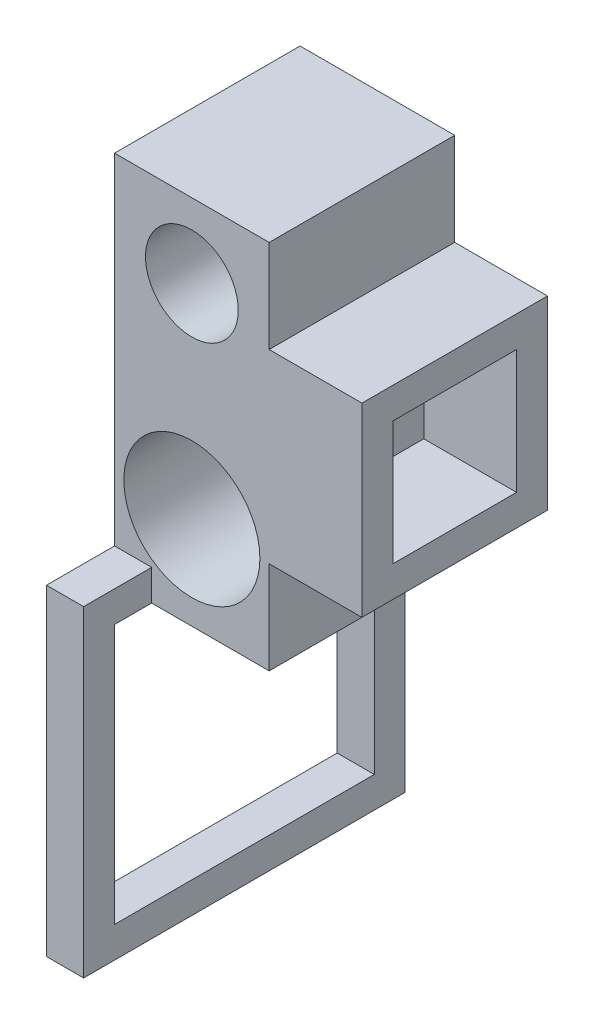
ISO-10303-21;
HEADER;
FILE_DESCRIPTION(('STEP AP214'),'2;1');
FILE_NAME('part.step','',(''),(''),'','','');
FILE_SCHEMA(('AUTOMOTIVE_DESIGN { 1 0 10303 214 1 1 1 1 }'));
ENDSEC;
DATA;
#1=APPLICATION_CONTEXT('core data for automotive mechanical design processes');
#2=APPLICATION_PROTOCOL_DEFINITION('international standard','automotive_design',2000,#1);
#3=PRODUCT_CONTEXT('',#1,'mechanical');
#4=PRODUCT('Part','Part','',(#3));
#5=PRODUCT_RELATED_PRODUCT_CATEGORY('part','',(#4));
#6=PRODUCT_DEFINITION_FORMATION('','',#4);
#7=PRODUCT_DEFINITION_CONTEXT('part definition',#1,'design');
#8=PRODUCT_DEFINITION('design','',#6,#7);
#9=PRODUCT_DEFINITION_SHAPE('','',#8);
#10=(LENGTH_UNIT() NAMED_UNIT(*) SI_UNIT(.MILLI.,.METRE.));
#11=(NAMED_UNIT(*) PLANE_ANGLE_UNIT() SI_UNIT($,.RADIAN.));
#12=(NAMED_UNIT(*) SI_UNIT($,.STERADIAN.) SOLID_ANGLE_UNIT());
#13=UNCERTAINTY_MEASURE_WITH_UNIT(LENGTH_MEASURE(1.E-05),#10,'distance_accuracy_value','');
#14=(GEOMETRIC_REPRESENTATION_CONTEXT(3) GLOBAL_UNCERTAINTY_ASSIGNED_CONTEXT((#13)) GLOBAL_UNIT_ASSIGNED_CONTEXT((#10,
#11,#12)) REPRESENTATION_CONTEXT('',''));
#15=CARTESIAN_POINT('',(0.,0.,0.));
#16=DIRECTION('',(0.,0.,1.));
#17=DIRECTION('',(1.,0.,0.));
#18=AXIS2_PLACEMENT_3D('',#15,#16,#17);
#19=CARTESIAN_POINT('',(12.5,-30.,15.));
#20=DIRECTION('',(-1.,0.,0.));
#21=DIRECTION('',(0.,-1.,0.));
#22=AXIS2_PLACEMENT_3D('',#19,#20,#21);
#23=PLANE('',#22);
#24=DIRECTION('',(0.,0.,-1.));
#25=VECTOR('',#24,1.);
#26=CARTESIAN_POINT('',(12.5,-15.,15.));
#27=LINE('',#26,#25);
#28=CARTESIAN_POINT('',(12.5,-15.,15.));
#29=VERTEX_POINT('',#28);
#30=CARTESIAN_POINT('',(12.5,-15.,-15.));
#31=VERTEX_POINT('',#30);
#32=EDGE_CURVE('E309',#29,#31,#27,.T.);
#33=ORIENTED_EDGE('',*,*,#32,.F.);
#34=DIRECTION('',(0.,1.,0.));
#35=VECTOR('',#34,1.);
#36=CARTESIAN_POINT('',(12.5,-30.,15.));
#37=LINE('',#36,#35);
#38=CARTESIAN_POINT('',(12.5,-30.,15.));
#39=VERTEX_POINT('',#38);
#40=EDGE_CURVE('E344',#39,#29,#37,.T.);
#41=ORIENTED_EDGE('',*,*,#40,.F.);
#42=DIRECTION('',(0.,0.,-1.));
#43=VECTOR('',#42,1.);
#44=CARTESIAN_POINT('',(12.5,-30.,15.));
#45=LINE('',#44,#43);
#46=CARTESIAN_POINT('',(12.5,-30.,-15.));
#47=VERTEX_POINT('',#46);
#48=EDGE_CURVE('E353',#39,#47,#45,.T.);
#49=ORIENTED_EDGE('',*,*,#48,.T.);
#50=DIRECTION('',(0.,1.,0.));
#51=VECTOR('',#50,1.);
#52=CARTESIAN_POINT('',(12.5,-30.,-15.));
#53=LINE('',#52,#51);
#54=EDGE_CURVE('E354',#47,#31,#53,.T.);
#55=ORIENTED_EDGE('',*,*,#54,.T.);
#56=EDGE_LOOP('',(#33,#41,#49,#55));
#57=FACE_BOUND('',#56,.T.);
#58=ADVANCED_FACE('F41',(#57),#23,.F.);
#59=DIRECTION('',(0.,0.,1.));
#60=VECTOR('',#59,1.);
#61=CARTESIAN_POINT('',(12.5,15.,15.));
#62=LINE('',#61,#60);
#63=CARTESIAN_POINT('',(12.5,15.,-15.));
#64=VERTEX_POINT('',#63);
#65=CARTESIAN_POINT('',(12.5,15.,15.));
#66=VERTEX_POINT('',#65);
#67=EDGE_CURVE('E304',#64,#66,#62,.T.);
#68=ORIENTED_EDGE('',*,*,#67,.F.);
#69=CARTESIAN_POINT('',(12.5,30.,-15.));
#70=VERTEX_POINT('',#69);
#71=EDGE_CURVE('E341',#64,#70,#53,.T.);
#72=ORIENTED_EDGE('',*,*,#71,.T.);
#73=DIRECTION('',(0.,0.,-1.));
#74=VECTOR('',#73,1.);
#75=CARTESIAN_POINT('',(12.5,30.,15.));
#76=LINE('',#75,#74);
#77=CARTESIAN_POINT('',(12.5,30.,15.));
#78=VERTEX_POINT('',#77);
#79=EDGE_CURVE('E11',#78,#70,#76,.T.);
#80=ORIENTED_EDGE('',*,*,#79,.F.);
#81=EDGE_CURVE('E348',#66,#78,#37,.T.);
#82=ORIENTED_EDGE('',*,*,#81,.F.);
#83=EDGE_LOOP('',(#68,#72,#80,#82));
#84=FACE_BOUND('',#83,.T.);
#85=ADVANCED_FACE('F424',(#84),#23,.F.);
#86=CARTESIAN_POINT('',(0.,0.,15.));
#87=DIRECTION('',(0.,0.,-1.));
#88=DIRECTION('',(-1.,0.,0.));
#89=AXIS2_PLACEMENT_3D('',#86,#87,#88);
#90=PLANE('',#89);
#91=DIRECTION('',(0.,-1.,0.));
#92=VECTOR('',#91,1.);
#93=CARTESIAN_POINT('',(-12.5,-30.,15.));
#94=LINE('',#93,#92);
#95=CARTESIAN_POINT('',(-12.5,30.,15.));
#96=VERTEX_POINT('',#95);
#97=CARTESIAN_POINT('',(-12.5,-25.,15.));
#98=VERTEX_POINT('',#97);
#99=EDGE_CURVE('E61',#96,#98,#94,.T.);
#100=ORIENTED_EDGE('',*,*,#99,.T.);
#101=DIRECTION('',(1.,0.,0.));
#102=VECTOR('',#101,1.);
#103=CARTESIAN_POINT('',(0.,-25.,15.));
#104=LINE('',#103,#102);
#105=CARTESIAN_POINT('',(-6.50000000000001,-25.,15.));
#106=VERTEX_POINT('',#105);
#107=EDGE_CURVE('E56',#98,#106,#104,.T.);
#108=ORIENTED_EDGE('',*,*,#107,.T.);
#109=DIRECTION('',(0.,-1.,0.));
#110=VECTOR('',#109,1.);
#111=CARTESIAN_POINT('',(-6.5,0.,15.));
#112=LINE('',#111,#110);
#113=CARTESIAN_POINT('',(-6.50000000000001,-30.,15.));
#114=VERTEX_POINT('',#113);
#115=EDGE_CURVE('E269',#106,#114,#112,.T.);
#116=ORIENTED_EDGE('',*,*,#115,.T.);
#117=DIRECTION('',(1.,0.,0.));
#118=VECTOR('',#117,1.);
#119=CARTESIAN_POINT('',(-12.5,-30.,15.));
#120=LINE('',#119,#118);
#121=EDGE_CURVE('E351',#114,#39,#120,.T.);
#122=ORIENTED_EDGE('',*,*,#121,.T.);
#123=ORIENTED_EDGE('',*,*,#40,.T.);
#124=DIRECTION('',(-1.,0.,0.));
#125=VECTOR('',#124,1.);
#126=CARTESIAN_POINT('',(27.5,-15.,15.));
#127=LINE('',#126,#125);
#128=CARTESIAN_POINT('',(27.5,-15.,15.));
#129=VERTEX_POINT('',#128);
#130=EDGE_CURVE('E322',#129,#29,#127,.T.);
#131=ORIENTED_EDGE('',*,*,#130,.F.);
#132=DIRECTION('',(0.,-1.,0.));
#133=VECTOR('',#132,1.);
#134=CARTESIAN_POINT('',(27.5,15.,15.));
#135=LINE('',#134,#133);
#136=CARTESIAN_POINT('',(27.5,15.,15.));
#137=VERTEX_POINT('',#136);
#138=EDGE_CURVE('E311',#137,#129,#135,.T.);
#139=ORIENTED_EDGE('',*,*,#138,.F.);
#140=DIRECTION('',(-1.,0.,0.));
#141=VECTOR('',#140,1.);
#142=CARTESIAN_POINT('',(27.5,15.,15.));
#143=LINE('',#142,#141);
#144=EDGE_CURVE('E325',#137,#66,#143,.T.);
#145=ORIENTED_EDGE('',*,*,#144,.T.);
#146=ORIENTED_EDGE('',*,*,#81,.T.);
#147=DIRECTION('',(-1.,0.,0.));
#148=VECTOR('',#147,1.);
#149=CARTESIAN_POINT('',(-12.5,30.,15.));
#150=LINE('',#149,#148);
#151=EDGE_CURVE('E347',#78,#96,#150,.T.);
#152=ORIENTED_EDGE('',*,*,#151,.T.);
#153=EDGE_LOOP('',(#100,#108,#116,#122,#123,#131,#139,#145,#146,#152));
#154=FACE_BOUND('',#153,.T.);
#155=CARTESIAN_POINT('',(0.,18.,15.));
#156=DIRECTION('',(0.,0.,1.));
#157=DIRECTION('',(1.,0.,0.));
#158=AXIS2_PLACEMENT_3D('',#155,#156,#157);
#159=CIRCLE('',#158,7.5);
#160=CARTESIAN_POINT('',(7.5,18.,15.));
#161=VERTEX_POINT('',#160);
#162=EDGE_CURVE('E338',#161,#161,#159,.T.);
#163=ORIENTED_EDGE('',*,*,#162,.F.);
#164=EDGE_LOOP('',(#163));
#165=FACE_BOUND('',#164,.T.);
#166=CARTESIAN_POINT('',(0.,-15.,15.));
#167=DIRECTION('',(0.,0.,1.));
#168=DIRECTION('',(1.,0.,0.));
#169=AXIS2_PLACEMENT_3D('',#166,#167,#168);
#170=CIRCLE('',#169,11.);
#171=CARTESIAN_POINT('',(11.,-15.,15.));
#172=VERTEX_POINT('',#171);
#173=EDGE_CURVE('E332',#172,#172,#170,.T.);
#174=ORIENTED_EDGE('',*,*,#173,.F.);
#175=EDGE_LOOP('',(#174));
#176=FACE_BOUND('',#175,.T.);
#177=ADVANCED_FACE('F401',(#154,#165,#176),#90,.F.);
#178=CARTESIAN_POINT('',(0.,0.,-15.));
#179=DIRECTION('',(0.,0.,-1.));
#180=DIRECTION('',(-1.,0.,0.));
#181=AXIS2_PLACEMENT_3D('',#178,#179,#180);
#182=PLANE('',#181);
#183=DIRECTION('',(1.,0.,0.));
#184=VECTOR('',#183,1.);
#185=CARTESIAN_POINT('',(0.,-25.,-15.));
#186=LINE('',#185,#184);
#187=CARTESIAN_POINT('',(-12.5,-25.,-15.));
#188=VERTEX_POINT('',#187);
#189=CARTESIAN_POINT('',(-6.50000000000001,-25.,-15.));
#190=VERTEX_POINT('',#189);
#191=EDGE_CURVE('E271',#188,#190,#186,.T.);
#192=ORIENTED_EDGE('',*,*,#191,.F.);
#193=DIRECTION('',(0.,-1.,0.));
#194=VECTOR('',#193,1.);
#195=CARTESIAN_POINT('',(-12.5,-30.,-15.));
#196=LINE('',#195,#194);
#197=CARTESIAN_POINT('',(-12.5,30.,-15.));
#198=VERTEX_POINT('',#197);
#199=EDGE_CURVE('E358',#198,#188,#196,.T.);
#200=ORIENTED_EDGE('',*,*,#199,.F.);
#201=DIRECTION('',(-1.,0.,0.));
#202=VECTOR('',#201,1.);
#203=CARTESIAN_POINT('',(-12.5,30.,-15.));
#204=LINE('',#203,#202);
#205=EDGE_CURVE('E356',#70,#198,#204,.T.);
#206=ORIENTED_EDGE('',*,*,#205,.F.);
#207=ORIENTED_EDGE('',*,*,#71,.F.);
#208=DIRECTION('',(-1.,0.,0.));
#209=VECTOR('',#208,1.);
#210=CARTESIAN_POINT('',(27.5,15.,-15.));
#211=LINE('',#210,#209);
#212=CARTESIAN_POINT('',(27.5,15.,-15.));
#213=VERTEX_POINT('',#212);
#214=EDGE_CURVE('E328',#213,#64,#211,.T.);
#215=ORIENTED_EDGE('',*,*,#214,.F.);
#216=DIRECTION('',(0.,1.,0.));
#217=VECTOR('',#216,1.);
#218=CARTESIAN_POINT('',(27.5,15.,-15.));
#219=LINE('',#218,#217);
#220=CARTESIAN_POINT('',(27.5,-15.,-15.));
#221=VERTEX_POINT('',#220);
#222=EDGE_CURVE('E305',#221,#213,#219,.T.);
#223=ORIENTED_EDGE('',*,*,#222,.F.);
#224=DIRECTION('',(-1.,0.,0.));
#225=VECTOR('',#224,1.);
#226=CARTESIAN_POINT('',(27.5,-15.,-15.));
#227=LINE('',#226,#225);
#228=EDGE_CURVE('E315',#221,#31,#227,.T.);
#229=ORIENTED_EDGE('',*,*,#228,.T.);
#230=ORIENTED_EDGE('',*,*,#54,.F.);
#231=DIRECTION('',(1.,0.,0.));
#232=VECTOR('',#231,1.);
#233=CARTESIAN_POINT('',(-12.5,-30.,-15.));
#234=LINE('',#233,#232);
#235=CARTESIAN_POINT('',(-6.50000000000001,-30.,-15.));
#236=VERTEX_POINT('',#235);
#237=EDGE_CURVE('E361',#236,#47,#234,.T.);
#238=ORIENTED_EDGE('',*,*,#237,.F.);
#239=DIRECTION('',(0.,-1.,0.));
#240=VECTOR('',#239,1.);
#241=CARTESIAN_POINT('',(-6.5,0.,-15.));
#242=LINE('',#241,#240);
#243=EDGE_CURVE('E261',#190,#236,#242,.T.);
#244=ORIENTED_EDGE('',*,*,#243,.F.);
#245=EDGE_LOOP('',(#192,#200,#206,#207,#215,#223,#229,#230,#238,#244));
#246=FACE_BOUND('',#245,.T.);
#247=CARTESIAN_POINT('',(0.,18.,-15.));
#248=DIRECTION('',(0.,0.,1.));
#249=DIRECTION('',(1.,0.,0.));
#250=AXIS2_PLACEMENT_3D('',#247,#248,#249);
#251=CIRCLE('',#250,7.5);
#252=CARTESIAN_POINT('',(7.5,18.,-15.));
#253=VERTEX_POINT('',#252);
#254=EDGE_CURVE('E335',#253,#253,#251,.T.);
#255=ORIENTED_EDGE('',*,*,#254,.T.);
#256=EDGE_LOOP('',(#255));
#257=FACE_BOUND('',#256,.T.);
#258=CARTESIAN_POINT('',(0.,-15.,-15.));
#259=DIRECTION('',(0.,0.,1.));
#260=DIRECTION('',(1.,0.,0.));
#261=AXIS2_PLACEMENT_3D('',#258,#259,#260);
#262=CIRCLE('',#261,11.);
#263=CARTESIAN_POINT('',(11.,-15.,-15.));
#264=VERTEX_POINT('',#263);
#265=EDGE_CURVE('E331',#264,#264,#262,.T.);
#266=ORIENTED_EDGE('',*,*,#265,.T.);
#267=EDGE_LOOP('',(#266));
#268=FACE_BOUND('',#267,.T.);
#269=ADVANCED_FACE('F376',(#246,#257,#268),#182,.T.);
#270=CARTESIAN_POINT('',(-12.5,30.,15.));
#271=DIRECTION('',(0.,-1.,0.));
#272=DIRECTION('',(1.,0.,0.));
#273=AXIS2_PLACEMENT_3D('',#270,#271,#272);
#274=PLANE('',#273);
#275=ORIENTED_EDGE('',*,*,#205,.T.);
#276=DIRECTION('',(0.,0.,-1.));
#277=VECTOR('',#276,1.);
#278=CARTESIAN_POINT('',(-12.5,30.,15.));
#279=LINE('',#278,#277);
#280=EDGE_CURVE('E49',#96,#198,#279,.T.);
#281=ORIENTED_EDGE('',*,*,#280,.F.);
#282=ORIENTED_EDGE('',*,*,#151,.F.);
#283=ORIENTED_EDGE('',*,*,#79,.T.);
#284=EDGE_LOOP('',(#275,#281,#282,#283));
#285=FACE_BOUND('',#284,.T.);
#286=ADVANCED_FACE('F426',(#285),#274,.F.);
#287=CARTESIAN_POINT('',(-12.5,-30.,15.));
#288=DIRECTION('',(1.,0.,0.));
#289=DIRECTION('',(0.,1.,0.));
#290=AXIS2_PLACEMENT_3D('',#287,#288,#289);
#291=PLANE('',#290);
#292=DIRECTION('',(0.,0.,-1.));
#293=VECTOR('',#292,1.);
#294=CARTESIAN_POINT('',(-12.5,-30.,15.));
#295=LINE('',#294,#293);
#296=CARTESIAN_POINT('',(-12.5,-30.,21.));
#297=VERTEX_POINT('',#296);
#298=CARTESIAN_POINT('',(-12.5,-30.,-21.));
#299=VERTEX_POINT('',#298);
#300=EDGE_CURVE('E365',#297,#299,#295,.T.);
#301=ORIENTED_EDGE('',*,*,#300,.F.);
#302=DIRECTION('',(0.,1.,0.));
#303=VECTOR('',#302,1.);
#304=CARTESIAN_POINT('',(-12.5,-30.,21.));
#305=LINE('',#304,#303);
#306=CARTESIAN_POINT('',(-12.5,-72.,21.));
#307=VERTEX_POINT('',#306);
#308=EDGE_CURVE('E215',#307,#297,#305,.T.);
#309=ORIENTED_EDGE('',*,*,#308,.F.);
#310=DIRECTION('',(0.,0.,1.));
#311=VECTOR('',#310,1.);
#312=CARTESIAN_POINT('',(-12.5,-72.,-21.));
#313=LINE('',#312,#311);
#314=CARTESIAN_POINT('',(-12.5,-72.,-21.));
#315=VERTEX_POINT('',#314);
#316=EDGE_CURVE('E218',#315,#307,#313,.T.);
#317=ORIENTED_EDGE('',*,*,#316,.F.);
#318=DIRECTION('',(0.,-1.,0.));
#319=VECTOR('',#318,1.);
#320=CARTESIAN_POINT('',(-12.5,-30.,-21.));
#321=LINE('',#320,#319);
#322=EDGE_CURVE('E196',#299,#315,#321,.T.);
#323=ORIENTED_EDGE('',*,*,#322,.F.);
#324=EDGE_LOOP('',(#301,#309,#317,#323));
#325=FACE_BOUND('',#324,.T.);
#326=ORIENTED_EDGE('',*,*,#199,.T.);
#327=DIRECTION('',(0.,0.,-1.));
#328=VECTOR('',#327,1.);
#329=CARTESIAN_POINT('',(-12.5,-25.,-26.));
#330=LINE('',#329,#328);
#331=CARTESIAN_POINT('',(-12.5,-25.,-26.));
#332=VERTEX_POINT('',#331);
#333=EDGE_CURVE('E228',#188,#332,#330,.T.);
#334=ORIENTED_EDGE('',*,*,#333,.T.);
#335=DIRECTION('',(0.,-1.,0.));
#336=VECTOR('',#335,1.);
#337=CARTESIAN_POINT('',(-12.5,-25.,-26.));
#338=LINE('',#337,#336);
#339=CARTESIAN_POINT('',(-12.5,-77.,-26.));
#340=VERTEX_POINT('',#339);
#341=EDGE_CURVE('E250',#332,#340,#338,.T.);
#342=ORIENTED_EDGE('',*,*,#341,.T.);
#343=DIRECTION('',(0.,0.,1.));
#344=VECTOR('',#343,1.);
#345=CARTESIAN_POINT('',(-12.5,-77.,-26.));
#346=LINE('',#345,#344);
#347=CARTESIAN_POINT('',(-12.5,-77.,26.));
#348=VERTEX_POINT('',#347);
#349=EDGE_CURVE('E253',#340,#348,#346,.T.);
#350=ORIENTED_EDGE('',*,*,#349,.T.);
#351=DIRECTION('',(0.,1.,0.));
#352=VECTOR('',#351,1.);
#353=CARTESIAN_POINT('',(-12.5,-25.,26.));
#354=LINE('',#353,#352);
#355=CARTESIAN_POINT('',(-12.5,-25.,26.));
#356=VERTEX_POINT('',#355);
#357=EDGE_CURVE('E256',#348,#356,#354,.T.);
#358=ORIENTED_EDGE('',*,*,#357,.T.);
#359=EDGE_CURVE('E247',#356,#98,#330,.T.);
#360=ORIENTED_EDGE('',*,*,#359,.T.);
#361=ORIENTED_EDGE('',*,*,#99,.F.);
#362=ORIENTED_EDGE('',*,*,#280,.T.);
#363=EDGE_LOOP('',(#326,#334,#342,#350,#358,#360,#361,#362));
#364=FACE_BOUND('',#363,.T.);
#365=ADVANCED_FACE('F370',(#325,#364),#291,.F.);
#366=CARTESIAN_POINT('',(-12.5,-30.,15.));
#367=DIRECTION('',(0.,1.,0.));
#368=DIRECTION('',(-1.,0.,0.));
#369=AXIS2_PLACEMENT_3D('',#366,#367,#368);
#370=PLANE('',#369);
#371=ORIENTED_EDGE('',*,*,#121,.F.);
#372=DIRECTION('',(0.,0.,-1.));
#373=VECTOR('',#372,1.);
#374=CARTESIAN_POINT('',(-6.50000000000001,-30.,-21.));
#375=LINE('',#374,#373);
#376=CARTESIAN_POINT('',(-6.50000000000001,-30.,21.));
#377=VERTEX_POINT('',#376);
#378=EDGE_CURVE('E201',#377,#114,#375,.T.);
#379=ORIENTED_EDGE('',*,*,#378,.F.);
#380=DIRECTION('',(-1.,0.,0.));
#381=VECTOR('',#380,1.);
#382=CARTESIAN_POINT('',(-6.50000000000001,-30.,21.));
#383=LINE('',#382,#381);
#384=EDGE_CURVE('E229',#377,#297,#383,.T.);
#385=ORIENTED_EDGE('',*,*,#384,.T.);
#386=ORIENTED_EDGE('',*,*,#300,.T.);
#387=DIRECTION('',(-1.,0.,0.));
#388=VECTOR('',#387,1.);
#389=CARTESIAN_POINT('',(-6.50000000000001,-30.,-21.));
#390=LINE('',#389,#388);
#391=CARTESIAN_POINT('',(-6.50000000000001,-30.,-21.));
#392=VERTEX_POINT('',#391);
#393=EDGE_CURVE('E226',#392,#299,#390,.T.);
#394=ORIENTED_EDGE('',*,*,#393,.F.);
#395=EDGE_CURVE('E213',#236,#392,#375,.T.);
#396=ORIENTED_EDGE('',*,*,#395,.F.);
#397=ORIENTED_EDGE('',*,*,#237,.T.);
#398=ORIENTED_EDGE('',*,*,#48,.F.);
#399=EDGE_LOOP('',(#371,#379,#385,#386,#394,#396,#397,#398));
#400=FACE_BOUND('',#399,.T.);
#401=ADVANCED_FACE('F407',(#400),#370,.F.);
#402=CARTESIAN_POINT('',(0.,18.,15.));
#403=DIRECTION('',(0.,0.,-1.));
#404=DIRECTION('',(-1.,0.,0.));
#405=AXIS2_PLACEMENT_3D('',#402,#403,#404);
#406=CYLINDRICAL_SURFACE('',#405,7.5);
#407=ORIENTED_EDGE('',*,*,#162,.T.);
#408=EDGE_LOOP('',(#407));
#409=FACE_BOUND('',#408,.T.);
#410=ORIENTED_EDGE('',*,*,#254,.F.);
#411=EDGE_LOOP('',(#410));
#412=FACE_BOUND('',#411,.T.);
#413=ADVANCED_FACE('F483',(#409,#412),#406,.F.);
#414=CARTESIAN_POINT('',(0.,-15.,15.));
#415=DIRECTION('',(0.,0.,-1.));
#416=DIRECTION('',(-1.,0.,0.));
#417=AXIS2_PLACEMENT_3D('',#414,#415,#416);
#418=CYLINDRICAL_SURFACE('',#417,11.);
#419=ORIENTED_EDGE('',*,*,#173,.T.);
#420=EDGE_LOOP('',(#419));
#421=FACE_BOUND('',#420,.T.);
#422=ORIENTED_EDGE('',*,*,#265,.F.);
#423=EDGE_LOOP('',(#422));
#424=FACE_BOUND('',#423,.T.);
#425=ADVANCED_FACE('F476',(#421,#424),#418,.F.);
#426=CARTESIAN_POINT('',(27.5,0.,0.));
#427=DIRECTION('',(1.,0.,0.));
#428=DIRECTION('',(0.,1.,0.));
#429=AXIS2_PLACEMENT_3D('',#426,#427,#428);
#430=PLANE('',#429);
#431=ORIENTED_EDGE('',*,*,#222,.T.);
#432=DIRECTION('',(0.,0.,1.));
#433=VECTOR('',#432,1.);
#434=CARTESIAN_POINT('',(27.5,15.,15.));
#435=LINE('',#434,#433);
#436=EDGE_CURVE('E308',#213,#137,#435,.T.);
#437=ORIENTED_EDGE('',*,*,#436,.T.);
#438=ORIENTED_EDGE('',*,*,#138,.T.);
#439=DIRECTION('',(0.,0.,-1.));
#440=VECTOR('',#439,1.);
#441=CARTESIAN_POINT('',(27.5,-15.,15.));
#442=LINE('',#441,#440);
#443=EDGE_CURVE('E313',#129,#221,#442,.T.);
#444=ORIENTED_EDGE('',*,*,#443,.T.);
#445=EDGE_LOOP('',(#431,#437,#438,#444));
#446=FACE_BOUND('',#445,.T.);
#447=DIRECTION('',(0.,0.,1.));
#448=VECTOR('',#447,1.);
#449=CARTESIAN_POINT('',(27.5,10.,10.));
#450=LINE('',#449,#448);
#451=CARTESIAN_POINT('',(27.5,10.,-10.));
#452=VERTEX_POINT('',#451);
#453=CARTESIAN_POINT('',(27.5,10.,10.));
#454=VERTEX_POINT('',#453);
#455=EDGE_CURVE('E277',#452,#454,#450,.T.);
#456=ORIENTED_EDGE('',*,*,#455,.F.);
#457=DIRECTION('',(0.,1.,0.));
#458=VECTOR('',#457,1.);
#459=CARTESIAN_POINT('',(27.5,10.,-10.));
#460=LINE('',#459,#458);
#461=CARTESIAN_POINT('',(27.5,-9.99999999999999,-10.));
#462=VERTEX_POINT('',#461);
#463=EDGE_CURVE('E275',#462,#452,#460,.T.);
#464=ORIENTED_EDGE('',*,*,#463,.F.);
#465=DIRECTION('',(0.,0.,-1.));
#466=VECTOR('',#465,1.);
#467=CARTESIAN_POINT('',(27.5,-9.99999999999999,10.));
#468=LINE('',#467,#466);
#469=CARTESIAN_POINT('',(27.5,-9.99999999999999,10.));
#470=VERTEX_POINT('',#469);
#471=EDGE_CURVE('E283',#470,#462,#468,.T.);
#472=ORIENTED_EDGE('',*,*,#471,.F.);
#473=DIRECTION('',(0.,-1.,0.));
#474=VECTOR('',#473,1.);
#475=CARTESIAN_POINT('',(27.5,10.,10.));
#476=LINE('',#475,#474);
#477=EDGE_CURVE('E280',#454,#470,#476,.T.);
#478=ORIENTED_EDGE('',*,*,#477,.F.);
#479=EDGE_LOOP('',(#456,#464,#472,#478));
#480=FACE_BOUND('',#479,.T.);
#481=ADVANCED_FACE('F417',(#446,#480),#430,.T.);
#482=CARTESIAN_POINT('',(27.5,15.,15.));
#483=DIRECTION('',(0.,-1.,0.));
#484=DIRECTION('',(1.,0.,0.));
#485=AXIS2_PLACEMENT_3D('',#482,#483,#484);
#486=PLANE('',#485);
#487=ORIENTED_EDGE('',*,*,#67,.T.);
#488=ORIENTED_EDGE('',*,*,#144,.F.);
#489=ORIENTED_EDGE('',*,*,#436,.F.);
#490=ORIENTED_EDGE('',*,*,#214,.T.);
#491=EDGE_LOOP('',(#487,#488,#489,#490));
#492=FACE_BOUND('',#491,.T.);
#493=ADVANCED_FACE('F422',(#492),#486,.F.);
#494=CARTESIAN_POINT('',(27.5,-15.,15.));
#495=DIRECTION('',(0.,1.,0.));
#496=DIRECTION('',(-1.,0.,0.));
#497=AXIS2_PLACEMENT_3D('',#494,#495,#496);
#498=PLANE('',#497);
#499=ORIENTED_EDGE('',*,*,#32,.T.);
#500=ORIENTED_EDGE('',*,*,#228,.F.);
#501=ORIENTED_EDGE('',*,*,#443,.F.);
#502=ORIENTED_EDGE('',*,*,#130,.T.);
#503=EDGE_LOOP('',(#499,#500,#501,#502));
#504=FACE_BOUND('',#503,.T.);
#505=ADVANCED_FACE('F412',(#504),#498,.F.);
#506=CARTESIAN_POINT('',(27.5,10.,-10.));
#507=DIRECTION('',(0.,0.,1.));
#508=DIRECTION('',(0.,-1.,0.));
#509=AXIS2_PLACEMENT_3D('',#506,#507,#508);
#510=PLANE('',#509);
#511=DIRECTION('',(0.,1.,0.));
#512=VECTOR('',#511,1.);
#513=CARTESIAN_POINT('',(12.5,10.,-10.));
#514=LINE('',#513,#512);
#515=CARTESIAN_POINT('',(12.5,-10.,-10.));
#516=VERTEX_POINT('',#515);
#517=CARTESIAN_POINT('',(12.5,10.,-10.));
#518=VERTEX_POINT('',#517);
#519=EDGE_CURVE('E274',#516,#518,#514,.T.);
#520=ORIENTED_EDGE('',*,*,#519,.F.);
#521=DIRECTION('',(-1.,0.,0.));
#522=VECTOR('',#521,1.);
#523=CARTESIAN_POINT('',(27.5,-9.99999999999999,-10.));
#524=LINE('',#523,#522);
#525=EDGE_CURVE('E285',#462,#516,#524,.T.);
#526=ORIENTED_EDGE('',*,*,#525,.F.);
#527=ORIENTED_EDGE('',*,*,#463,.T.);
#528=DIRECTION('',(-1.,0.,0.));
#529=VECTOR('',#528,1.);
#530=CARTESIAN_POINT('',(27.5,10.,-10.));
#531=LINE('',#530,#529);
#532=EDGE_CURVE('E301',#452,#518,#531,.T.);
#533=ORIENTED_EDGE('',*,*,#532,.T.);
#534=EDGE_LOOP('',(#520,#526,#527,#533));
#535=FACE_BOUND('',#534,.T.);
#536=ADVANCED_FACE('F457',(#535),#510,.T.);
#537=CARTESIAN_POINT('',(27.5,10.,10.));
#538=DIRECTION('',(0.,-1.,0.));
#539=DIRECTION('',(1.,0.,0.));
#540=AXIS2_PLACEMENT_3D('',#537,#538,#539);
#541=PLANE('',#540);
#542=DIRECTION('',(0.,0.,1.));
#543=VECTOR('',#542,1.);
#544=CARTESIAN_POINT('',(12.5,10.,10.));
#545=LINE('',#544,#543);
#546=CARTESIAN_POINT('',(12.5,10.,10.));
#547=VERTEX_POINT('',#546);
#548=EDGE_CURVE('E288',#518,#547,#545,.T.);
#549=ORIENTED_EDGE('',*,*,#548,.F.);
#550=ORIENTED_EDGE('',*,*,#532,.F.);
#551=ORIENTED_EDGE('',*,*,#455,.T.);
#552=DIRECTION('',(-1.,0.,0.));
#553=VECTOR('',#552,1.);
#554=CARTESIAN_POINT('',(27.5,10.,10.));
#555=LINE('',#554,#553);
#556=EDGE_CURVE('E299',#454,#547,#555,.T.);
#557=ORIENTED_EDGE('',*,*,#556,.T.);
#558=EDGE_LOOP('',(#549,#550,#551,#557));
#559=FACE_BOUND('',#558,.T.);
#560=ADVANCED_FACE('F461',(#559),#541,.T.);
#561=CARTESIAN_POINT('',(27.5,10.,10.));
#562=DIRECTION('',(0.,0.,-1.));
#563=DIRECTION('',(0.,1.,0.));
#564=AXIS2_PLACEMENT_3D('',#561,#562,#563);
#565=PLANE('',#564);
#566=DIRECTION('',(0.,-1.,0.));
#567=VECTOR('',#566,1.);
#568=CARTESIAN_POINT('',(12.5,10.,10.));
#569=LINE('',#568,#567);
#570=CARTESIAN_POINT('',(12.5,-10.,10.));
#571=VERTEX_POINT('',#570);
#572=EDGE_CURVE('E291',#547,#571,#569,.T.);
#573=ORIENTED_EDGE('',*,*,#572,.F.);
#574=ORIENTED_EDGE('',*,*,#556,.F.);
#575=ORIENTED_EDGE('',*,*,#477,.T.);
#576=DIRECTION('',(-1.,0.,0.));
#577=VECTOR('',#576,1.);
#578=CARTESIAN_POINT('',(27.5,-9.99999999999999,10.));
#579=LINE('',#578,#577);
#580=EDGE_CURVE('E297',#470,#571,#579,.T.);
#581=ORIENTED_EDGE('',*,*,#580,.T.);
#582=EDGE_LOOP('',(#573,#574,#575,#581));
#583=FACE_BOUND('',#582,.T.);
#584=ADVANCED_FACE('F447',(#583),#565,.T.);
#585=CARTESIAN_POINT('',(27.5,-9.99999999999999,10.));
#586=DIRECTION('',(0.,1.,0.));
#587=DIRECTION('',(-1.,0.,0.));
#588=AXIS2_PLACEMENT_3D('',#585,#586,#587);
#589=PLANE('',#588);
#590=DIRECTION('',(0.,0.,-1.));
#591=VECTOR('',#590,1.);
#592=CARTESIAN_POINT('',(12.5,-10.,10.));
#593=LINE('',#592,#591);
#594=EDGE_CURVE('E278',#571,#516,#593,.T.);
#595=ORIENTED_EDGE('',*,*,#594,.F.);
#596=ORIENTED_EDGE('',*,*,#580,.F.);
#597=ORIENTED_EDGE('',*,*,#471,.T.);
#598=ORIENTED_EDGE('',*,*,#525,.T.);
#599=EDGE_LOOP('',(#595,#596,#597,#598));
#600=FACE_BOUND('',#599,.T.);
#601=ADVANCED_FACE('F440',(#600),#589,.T.);
#602=ORIENTED_EDGE('',*,*,#594,.T.);
#603=ORIENTED_EDGE('',*,*,#519,.T.);
#604=ORIENTED_EDGE('',*,*,#548,.T.);
#605=ORIENTED_EDGE('',*,*,#572,.T.);
#606=EDGE_LOOP('',(#602,#603,#604,#605));
#607=FACE_BOUND('',#606,.T.);
#608=ADVANCED_FACE('F43',(#607),#23,.F.);
#609=CARTESIAN_POINT('',(-6.50000000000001,-25.,-26.));
#610=DIRECTION('',(0.,1.,0.));
#611=DIRECTION('',(-1.,0.,0.));
#612=AXIS2_PLACEMENT_3D('',#609,#610,#611);
#613=PLANE('',#612);
#614=ORIENTED_EDGE('',*,*,#107,.F.);
#615=ORIENTED_EDGE('',*,*,#359,.F.);
#616=DIRECTION('',(-1.,0.,0.));
#617=VECTOR('',#616,1.);
#618=CARTESIAN_POINT('',(-6.50000000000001,-25.,26.));
#619=LINE('',#618,#617);
#620=CARTESIAN_POINT('',(-6.50000000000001,-25.,26.));
#621=VERTEX_POINT('',#620);
#622=EDGE_CURVE('E259',#621,#356,#619,.T.);
#623=ORIENTED_EDGE('',*,*,#622,.F.);
#624=DIRECTION('',(0.,0.,-1.));
#625=VECTOR('',#624,1.);
#626=CARTESIAN_POINT('',(-6.50000000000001,-25.,-26.));
#627=LINE('',#626,#625);
#628=EDGE_CURVE('E233',#621,#106,#627,.T.);
#629=ORIENTED_EDGE('',*,*,#628,.T.);
#630=EDGE_LOOP('',(#614,#615,#623,#629));
#631=FACE_BOUND('',#630,.T.);
#632=ADVANCED_FACE('F399',(#631),#613,.T.);
#633=CARTESIAN_POINT('',(-6.5,0.,0.));
#634=DIRECTION('',(1.,0.,0.));
#635=DIRECTION('',(0.,1.,0.));
#636=AXIS2_PLACEMENT_3D('',#633,#634,#635);
#637=PLANE('',#636);
#638=ORIENTED_EDGE('',*,*,#115,.F.);
#639=ORIENTED_EDGE('',*,*,#628,.F.);
#640=DIRECTION('',(0.,1.,0.));
#641=VECTOR('',#640,1.);
#642=CARTESIAN_POINT('',(-6.50000000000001,-25.,26.));
#643=LINE('',#642,#641);
#644=CARTESIAN_POINT('',(-6.50000000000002,-77.,26.));
#645=VERTEX_POINT('',#644);
#646=EDGE_CURVE('E243',#645,#621,#643,.T.);
#647=ORIENTED_EDGE('',*,*,#646,.F.);
#648=DIRECTION('',(0.,0.,1.));
#649=VECTOR('',#648,1.);
#650=CARTESIAN_POINT('',(-6.50000000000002,-77.,-26.));
#651=LINE('',#650,#649);
#652=CARTESIAN_POINT('',(-6.50000000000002,-77.,-26.));
#653=VERTEX_POINT('',#652);
#654=EDGE_CURVE('E240',#653,#645,#651,.T.);
#655=ORIENTED_EDGE('',*,*,#654,.F.);
#656=DIRECTION('',(0.,-1.,0.));
#657=VECTOR('',#656,1.);
#658=CARTESIAN_POINT('',(-6.50000000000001,-25.,-26.));
#659=LINE('',#658,#657);
#660=CARTESIAN_POINT('',(-6.50000000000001,-25.,-26.));
#661=VERTEX_POINT('',#660);
#662=EDGE_CURVE('E236',#661,#653,#659,.T.);
#663=ORIENTED_EDGE('',*,*,#662,.F.);
#664=EDGE_CURVE('E237',#190,#661,#627,.T.);
#665=ORIENTED_EDGE('',*,*,#664,.F.);
#666=ORIENTED_EDGE('',*,*,#243,.T.);
#667=ORIENTED_EDGE('',*,*,#395,.T.);
#668=DIRECTION('',(0.,-1.,0.));
#669=VECTOR('',#668,1.);
#670=CARTESIAN_POINT('',(-6.50000000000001,-30.,-21.));
#671=LINE('',#670,#669);
#672=CARTESIAN_POINT('',(-6.50000000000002,-72.,-21.));
#673=VERTEX_POINT('',#672);
#674=EDGE_CURVE('E194',#392,#673,#671,.T.);
#675=ORIENTED_EDGE('',*,*,#674,.T.);
#676=DIRECTION('',(0.,0.,1.));
#677=VECTOR('',#676,1.);
#678=CARTESIAN_POINT('',(-6.50000000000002,-72.,-21.));
#679=LINE('',#678,#677);
#680=CARTESIAN_POINT('',(-6.50000000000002,-72.,21.));
#681=VERTEX_POINT('',#680);
#682=EDGE_CURVE('E205',#673,#681,#679,.T.);
#683=ORIENTED_EDGE('',*,*,#682,.T.);
#684=DIRECTION('',(0.,1.,0.));
#685=VECTOR('',#684,1.);
#686=CARTESIAN_POINT('',(-6.50000000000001,-30.,21.));
#687=LINE('',#686,#685);
#688=EDGE_CURVE('E209',#681,#377,#687,.T.);
#689=ORIENTED_EDGE('',*,*,#688,.T.);
#690=ORIENTED_EDGE('',*,*,#378,.T.);
#691=EDGE_LOOP('',(#638,#639,#647,#655,#663,#665,#666,#667,#675,#683,#689,#690));
#692=FACE_BOUND('',#691,.T.);
#693=ADVANCED_FACE('F211',(#692),#637,.T.);
#694=ORIENTED_EDGE('',*,*,#333,.F.);
#695=ORIENTED_EDGE('',*,*,#191,.T.);
#696=ORIENTED_EDGE('',*,*,#664,.T.);
#697=DIRECTION('',(-1.,0.,0.));
#698=VECTOR('',#697,1.);
#699=CARTESIAN_POINT('',(-6.50000000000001,-25.,-26.));
#700=LINE('',#699,#698);
#701=EDGE_CURVE('E246',#661,#332,#700,.T.);
#702=ORIENTED_EDGE('',*,*,#701,.T.);
#703=EDGE_LOOP('',(#694,#695,#696,#702));
#704=FACE_BOUND('',#703,.T.);
#705=ADVANCED_FACE('F383',(#704),#613,.T.);
#706=CARTESIAN_POINT('',(-6.50000000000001,-25.,26.));
#707=DIRECTION('',(0.,0.,1.));
#708=DIRECTION('',(0.,-1.,0.));
#709=AXIS2_PLACEMENT_3D('',#706,#707,#708);
#710=PLANE('',#709);
#711=ORIENTED_EDGE('',*,*,#357,.F.);
#712=DIRECTION('',(-1.,0.,0.));
#713=VECTOR('',#712,1.);
#714=CARTESIAN_POINT('',(-6.50000000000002,-77.,26.));
#715=LINE('',#714,#713);
#716=EDGE_CURVE('E262',#645,#348,#715,.T.);
#717=ORIENTED_EDGE('',*,*,#716,.F.);
#718=ORIENTED_EDGE('',*,*,#646,.T.);
#719=ORIENTED_EDGE('',*,*,#622,.T.);
#720=EDGE_LOOP('',(#711,#717,#718,#719));
#721=FACE_BOUND('',#720,.T.);
#722=ADVANCED_FACE('F395',(#721),#710,.T.);
#723=CARTESIAN_POINT('',(-6.50000000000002,-77.,-26.));
#724=DIRECTION('',(0.,-1.,0.));
#725=DIRECTION('',(1.,0.,0.));
#726=AXIS2_PLACEMENT_3D('',#723,#724,#725);
#727=PLANE('',#726);
#728=ORIENTED_EDGE('',*,*,#349,.F.);
#729=DIRECTION('',(-1.,0.,0.));
#730=VECTOR('',#729,1.);
#731=CARTESIAN_POINT('',(-6.50000000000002,-77.,-26.));
#732=LINE('',#731,#730);
#733=EDGE_CURVE('E264',#653,#340,#732,.T.);
#734=ORIENTED_EDGE('',*,*,#733,.F.);
#735=ORIENTED_EDGE('',*,*,#654,.T.);
#736=ORIENTED_EDGE('',*,*,#716,.T.);
#737=EDGE_LOOP('',(#728,#734,#735,#736));
#738=FACE_BOUND('',#737,.T.);
#739=ADVANCED_FACE('F607',(#738),#727,.T.);
#740=CARTESIAN_POINT('',(-6.50000000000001,-25.,-26.));
#741=DIRECTION('',(0.,0.,-1.));
#742=DIRECTION('',(0.,1.,0.));
#743=AXIS2_PLACEMENT_3D('',#740,#741,#742);
#744=PLANE('',#743);
#745=ORIENTED_EDGE('',*,*,#341,.F.);
#746=ORIENTED_EDGE('',*,*,#701,.F.);
#747=ORIENTED_EDGE('',*,*,#662,.T.);
#748=ORIENTED_EDGE('',*,*,#733,.T.);
#749=EDGE_LOOP('',(#745,#746,#747,#748));
#750=FACE_BOUND('',#749,.T.);
#751=ADVANCED_FACE('F390',(#750),#744,.T.);
#752=CARTESIAN_POINT('',(-6.50000000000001,-30.,-21.));
#753=DIRECTION('',(0.,0.,-1.));
#754=DIRECTION('',(0.,1.,0.));
#755=AXIS2_PLACEMENT_3D('',#752,#753,#754);
#756=PLANE('',#755);
#757=ORIENTED_EDGE('',*,*,#322,.T.);
#758=DIRECTION('',(-1.,0.,0.));
#759=VECTOR('',#758,1.);
#760=CARTESIAN_POINT('',(-6.50000000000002,-72.,-21.));
#761=LINE('',#760,#759);
#762=EDGE_CURVE('E189',#673,#315,#761,.T.);
#763=ORIENTED_EDGE('',*,*,#762,.F.);
#764=ORIENTED_EDGE('',*,*,#674,.F.);
#765=ORIENTED_EDGE('',*,*,#393,.T.);
#766=EDGE_LOOP('',(#757,#763,#764,#765));
#767=FACE_BOUND('',#766,.T.);
#768=ADVANCED_FACE('F191',(#767),#756,.F.);
#769=CARTESIAN_POINT('',(-6.50000000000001,-30.,21.));
#770=DIRECTION('',(0.,0.,1.));
#771=DIRECTION('',(0.,-1.,0.));
#772=AXIS2_PLACEMENT_3D('',#769,#770,#771);
#773=PLANE('',#772);
#774=ORIENTED_EDGE('',*,*,#308,.T.);
#775=ORIENTED_EDGE('',*,*,#384,.F.);
#776=ORIENTED_EDGE('',*,*,#688,.F.);
#777=DIRECTION('',(-1.,0.,0.));
#778=VECTOR('',#777,1.);
#779=CARTESIAN_POINT('',(-6.50000000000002,-72.,21.));
#780=LINE('',#779,#778);
#781=EDGE_CURVE('E200',#681,#307,#780,.T.);
#782=ORIENTED_EDGE('',*,*,#781,.T.);
#783=EDGE_LOOP('',(#774,#775,#776,#782));
#784=FACE_BOUND('',#783,.T.);
#785=ADVANCED_FACE('F635',(#784),#773,.F.);
#786=CARTESIAN_POINT('',(-6.50000000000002,-72.,-21.));
#787=DIRECTION('',(0.,-1.,0.));
#788=DIRECTION('',(1.,0.,0.));
#789=AXIS2_PLACEMENT_3D('',#786,#787,#788);
#790=PLANE('',#789);
#791=ORIENTED_EDGE('',*,*,#316,.T.);
#792=ORIENTED_EDGE('',*,*,#781,.F.);
#793=ORIENTED_EDGE('',*,*,#682,.F.);
#794=ORIENTED_EDGE('',*,*,#762,.T.);
#795=EDGE_LOOP('',(#791,#792,#793,#794));
#796=FACE_BOUND('',#795,.T.);
#797=ADVANCED_FACE('F206',(#796),#790,.F.);
#798=CLOSED_SHELL('',(#58,#85,#177,#269,#286,#365,#401,#413,#425,#481,#493,#505,#536,#560,#584,
#601,#608,#632,#693,#705,#722,#739,#751,#768,#785,#797));
#799=MANIFOLD_SOLID_BREP('B2',#798);
#800=ADVANCED_BREP_SHAPE_REPRESENTATION('',(#18,#799),#14);
#801=SHAPE_DEFINITION_REPRESENTATION(#9,#800);
ENDSEC;
END-ISO-10303-21;
